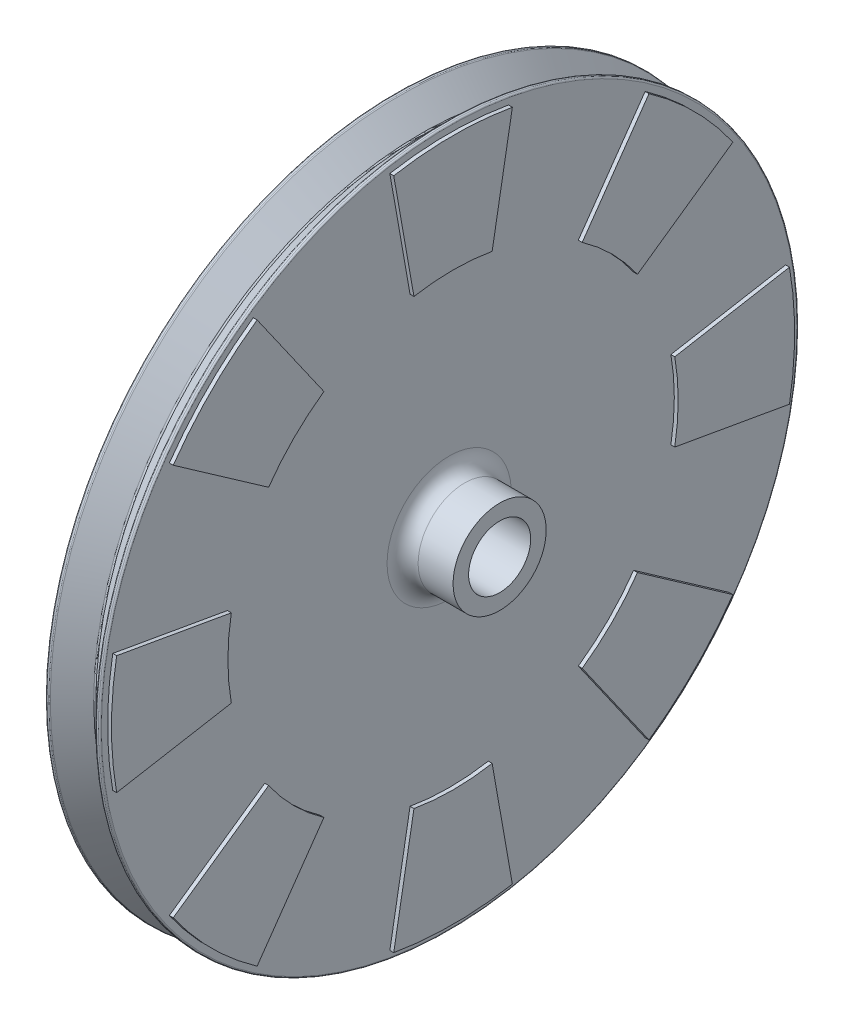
from build123d import *

# Parameters (mm, degrees)
EXTRUSION1_DEPTH             = 0.5
R_P_TITION_CIRCULAIRE1_COUNT = 8
CONG_1_R                     = 0.2
ESQUISSE3_R                  = 2.023797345
ENL_V_MAT_EXTRU_1_DEPTH      = 0.25


with BuildPart() as part:
    # Esquisse1 → R_volution2 (revolve)
    with BuildSketch(Plane.XY, mode=Mode.PRIVATE) as r_volution2_sk:
        with BuildLine():
            Line((-3, 45), (0, 42))
            Line((0, 42), (3, 45))
            Line((3, 45), (3.5, 45))
            Line((3.5, 45), (3.5, 8))
            ThreePointArc((3.5, 8), (4.085786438, 6.585786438), (5.5, 6))
            Line((5.5, 6), (10, 6))
            Line((10, 6), (10, 4))
            Line((10, 4), (0, 4))
            Line((0, 4), (0, 0))
            Line((0, 0), (-3.5, 0))
            Line((-3.5, 0), (-3.5, 45))
            Line((-3.5, 45), (-3, 45))
        make_face()
    revolve(r_volution2_sk.sketch.rotate(Axis((0, 0, 0), (1, 0, 0)), 90), axis=Axis((0, 0, 0), (1, 0, 0)))

    # Esquisse2 → Extrusion1 (add)
    with BuildSketch(Plane(origin=(3.5, 0, 0), x_dir=(0, 0, -1), z_dir=(1, 0, 0))):
        with BuildLine():
            Line((5.035797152, 28.559424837), (7.640519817, 43.331541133))
            ThreePointArc((7.640519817, 43.331541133), (0, 44), (-7.640519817, 43.331541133))
            Line((-7.640519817, 43.331541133), (-5.035797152, 28.559424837))
            ThreePointArc((-5.035797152, 28.559424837), (0, 29), (5.035797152, 28.559424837))
        make_face()
    extrusion1 = extrude(amount=EXTRUSION1_DEPTH)

    # R_p_tition circulaire1: Extrusion1 ×8 about axis
    r_p_tition_circulaire1_axis = Axis((0, 0, 0), (1, 0, 0))
    for i in range(1, R_P_TITION_CIRCULAIRE1_COUNT):
        add(extrusion1.rotate(r_p_tition_circulaire1_axis, i * 360 / R_P_TITION_CIRCULAIRE1_COUNT))

    # Cong_1
    cong_1_edges = [part.edges().sort_by_distance(p)[0] for p in [
        (0, 0, -42),
        (3, 0, -45),
        (3.5, 0, -45),
        (-3.5, 0, -45),
        (-3, 0, -45),
    ]]
    fillet(cong_1_edges, radius=CONG_1_R)

    # Esquisse3 → Enl_v. mat.-Extru.1 (cut)
    with BuildSketch(Plane.ZY.offset(3.5)):
        with Locations((-32.017661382, 10.761647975)):
            Circle(ESQUISSE3_R)
    extrude(amount=-ENL_V_MAT_EXTRU_1_DEPTH, mode=Mode.SUBTRACT)


solid = part.part
